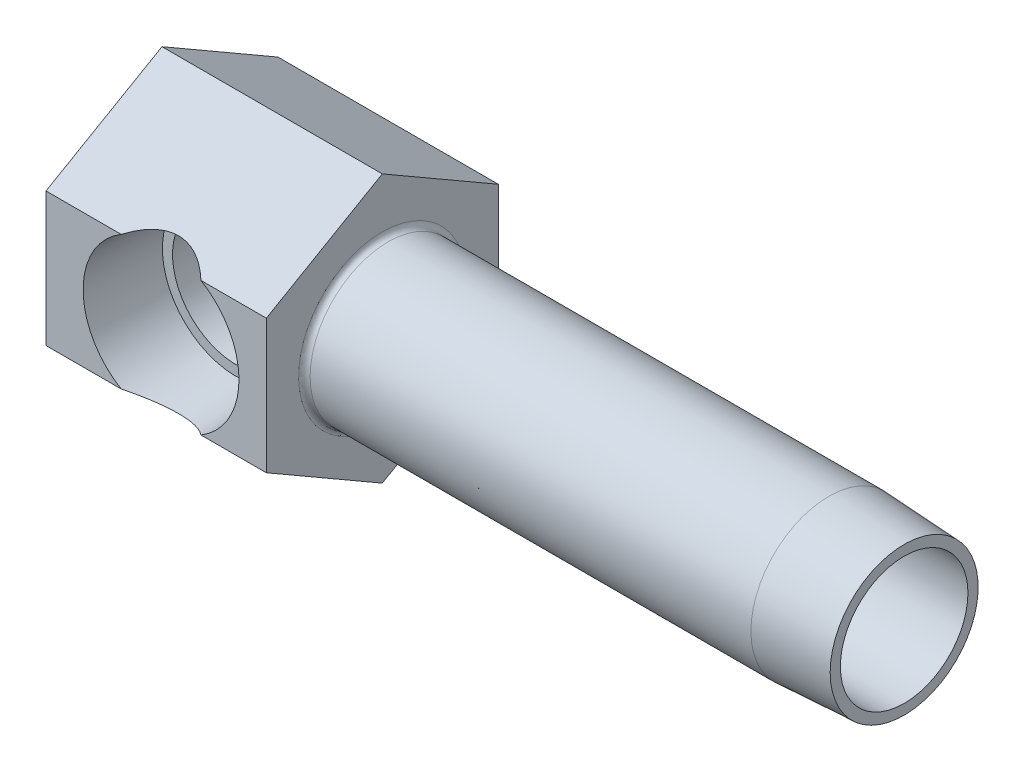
ISO-10303-21;
HEADER;
FILE_DESCRIPTION(('STEP AP214'),'2;1');
FILE_NAME('part.step','',(''),(''),'','','');
FILE_SCHEMA(('AUTOMOTIVE_DESIGN { 1 0 10303 214 1 1 1 1 }'));
ENDSEC;
DATA;
#1=APPLICATION_CONTEXT('core data for automotive mechanical design processes');
#2=APPLICATION_PROTOCOL_DEFINITION('international standard','automotive_design',2000,#1);
#3=PRODUCT_CONTEXT('',#1,'mechanical');
#4=PRODUCT('Part','Part','',(#3));
#5=PRODUCT_RELATED_PRODUCT_CATEGORY('part','',(#4));
#6=PRODUCT_DEFINITION_FORMATION('','',#4);
#7=PRODUCT_DEFINITION_CONTEXT('part definition',#1,'design');
#8=PRODUCT_DEFINITION('design','',#6,#7);
#9=PRODUCT_DEFINITION_SHAPE('','',#8);
#10=(LENGTH_UNIT() NAMED_UNIT(*) SI_UNIT(.MILLI.,.METRE.));
#11=(NAMED_UNIT(*) PLANE_ANGLE_UNIT() SI_UNIT($,.RADIAN.));
#12=(NAMED_UNIT(*) SI_UNIT($,.STERADIAN.) SOLID_ANGLE_UNIT());
#13=UNCERTAINTY_MEASURE_WITH_UNIT(LENGTH_MEASURE(1.E-05),#10,'distance_accuracy_value','');
#14=(GEOMETRIC_REPRESENTATION_CONTEXT(3) GLOBAL_UNCERTAINTY_ASSIGNED_CONTEXT((#13)) GLOBAL_UNIT_ASSIGNED_CONTEXT((#10,
#11,#12)) REPRESENTATION_CONTEXT('',''));
#15=CARTESIAN_POINT('',(0.,0.,0.));
#16=DIRECTION('',(0.,0.,1.));
#17=DIRECTION('',(1.,0.,0.));
#18=AXIS2_PLACEMENT_3D('',#15,#16,#17);
#19=CARTESIAN_POINT('',(63.5,0.,15.875));
#20=DIRECTION('',(-1.,0.,0.));
#21=DIRECTION('',(0.,0.,1.));
#22=AXIS2_PLACEMENT_3D('',#19,#20,#21);
#23=CYLINDRICAL_SURFACE('',#22,10.668);
#24=CARTESIAN_POINT('',(30.9499,0.,15.875));
#25=DIRECTION('',(1.,0.,0.));
#26=DIRECTION('',(0.,1.,0.));
#27=AXIS2_PLACEMENT_3D('',#24,#25,#26);
#28=CIRCLE('',#27,10.668);
#29=CARTESIAN_POINT('',(30.9499,10.668,15.875));
#30=VERTEX_POINT('',#29);
#31=EDGE_CURVE('E191',#30,#30,#28,.T.);
#32=ORIENTED_EDGE('',*,*,#31,.T.);
#33=EDGE_LOOP('',(#32));
#34=FACE_BOUND('',#33,.T.);
#35=CARTESIAN_POINT('',(91.2876,0.,15.875));
#36=DIRECTION('',(-1.,0.,0.));
#37=DIRECTION('',(0.,0.,1.));
#38=AXIS2_PLACEMENT_3D('',#35,#36,#37);
#39=CIRCLE('',#38,10.668);
#40=CARTESIAN_POINT('',(91.2876,0.,26.543));
#41=VERTEX_POINT('',#40);
#42=EDGE_CURVE('E256',#41,#41,#39,.T.);
#43=ORIENTED_EDGE('',*,*,#42,.T.);
#44=EDGE_LOOP('',(#43));
#45=FACE_BOUND('',#44,.T.);
#46=ADVANCED_FACE('F15',(#34,#45),#23,.T.);
#47=CARTESIAN_POINT('',(30.1625,18.3308710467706,15.875));
#48=DIRECTION('',(0.,-0.866025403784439,-0.5));
#49=DIRECTION('',(0.,0.5,-0.866025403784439));
#50=AXIS2_PLACEMENT_3D('',#47,#48,#49);
#51=PLANE('',#50);
#52=CARTESIAN_POINT('',(15.748,-1.05255916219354,49.4480859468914));
#53=DIRECTION('',(0.,-0.866025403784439,-0.5));
#54=DIRECTION('',(0.,-0.5,0.866025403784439));
#55=AXIS2_PLACEMENT_3D('',#52,#53,#54);
#56=ELLIPSE('',#55,23.191034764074,11.5476466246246);
#57=CARTESIAN_POINT('',(21.2070306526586,9.16543552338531,31.75));
#58=VERTEX_POINT('',#57);
#59=CARTESIAN_POINT('',(10.2889693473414,9.16543552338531,31.75));
#60=VERTEX_POINT('',#59);
#61=EDGE_CURVE('E135',#58,#60,#56,.F.);
#62=ORIENTED_EDGE('',*,*,#61,.F.);
#63=DIRECTION('',(-1.,0.,0.));
#64=VECTOR('',#63,1.);
#65=CARTESIAN_POINT('',(30.1625,9.16543552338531,31.75));
#66=LINE('',#65,#64);
#67=CARTESIAN_POINT('',(30.1625,9.16543552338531,31.75));
#68=VERTEX_POINT('',#67);
#69=EDGE_CURVE('E179',#68,#58,#66,.T.);
#70=ORIENTED_EDGE('',*,*,#69,.F.);
#71=DIRECTION('',(0.,-0.5,0.866025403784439));
#72=VECTOR('',#71,1.);
#73=CARTESIAN_POINT('',(30.1625,18.3308710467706,15.875));
#74=LINE('',#73,#72);
#75=CARTESIAN_POINT('',(30.1625,18.3308710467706,15.875));
#76=VERTEX_POINT('',#75);
#77=EDGE_CURVE('E163',#76,#68,#74,.T.);
#78=ORIENTED_EDGE('',*,*,#77,.F.);
#79=DIRECTION('',(-1.,0.,0.));
#80=VECTOR('',#79,1.);
#81=CARTESIAN_POINT('',(30.1625,18.3308710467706,15.875));
#82=LINE('',#81,#80);
#83=CARTESIAN_POINT('',(0.,18.3308710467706,15.875));
#84=VERTEX_POINT('',#83);
#85=EDGE_CURVE('E182',#76,#84,#82,.T.);
#86=ORIENTED_EDGE('',*,*,#85,.T.);
#87=DIRECTION('',(0.,-0.5,0.866025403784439));
#88=VECTOR('',#87,1.);
#89=CARTESIAN_POINT('',(0.,18.3308710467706,15.875));
#90=LINE('',#89,#88);
#91=CARTESIAN_POINT('',(0.,9.16543552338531,31.75));
#92=VERTEX_POINT('',#91);
#93=EDGE_CURVE('E144',#84,#92,#90,.T.);
#94=ORIENTED_EDGE('',*,*,#93,.T.);
#95=EDGE_CURVE('E178',#60,#92,#66,.T.);
#96=ORIENTED_EDGE('',*,*,#95,.F.);
#97=EDGE_LOOP('',(#62,#70,#78,#86,#94,#96));
#98=FACE_BOUND('',#97,.T.);
#99=ADVANCED_FACE('F210',(#98),#51,.F.);
#100=CARTESIAN_POINT('',(30.1625,9.16543552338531,31.75));
#101=DIRECTION('',(0.,0.,-1.));
#102=DIRECTION('',(-1.,0.,0.));
#103=AXIS2_PLACEMENT_3D('',#100,#101,#102);
#104=PLANE('',#103);
#105=CARTESIAN_POINT('',(15.748,0.,31.75));
#106=DIRECTION('',(0.,0.,-1.));
#107=DIRECTION('',(-1.,0.,0.));
#108=AXIS2_PLACEMENT_3D('',#105,#106,#107);
#109=CIRCLE('',#108,10.668);
#110=CARTESIAN_POINT('',(21.2070306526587,-9.1654355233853,31.75));
#111=VERTEX_POINT('',#110);
#112=EDGE_CURVE('E133',#58,#111,#109,.T.);
#113=ORIENTED_EDGE('',*,*,#112,.T.);
#114=DIRECTION('',(-1.,0.,0.));
#115=VECTOR('',#114,1.);
#116=CARTESIAN_POINT('',(30.1625,-9.1654355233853,31.75));
#117=LINE('',#116,#115);
#118=CARTESIAN_POINT('',(30.1625,-9.1654355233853,31.75));
#119=VERTEX_POINT('',#118);
#120=EDGE_CURVE('E175',#119,#111,#117,.T.);
#121=ORIENTED_EDGE('',*,*,#120,.F.);
#122=DIRECTION('',(0.,-1.,0.));
#123=VECTOR('',#122,1.);
#124=CARTESIAN_POINT('',(30.1625,9.16543552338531,31.75));
#125=LINE('',#124,#123);
#126=EDGE_CURVE('E165',#68,#119,#125,.T.);
#127=ORIENTED_EDGE('',*,*,#126,.F.);
#128=ORIENTED_EDGE('',*,*,#69,.T.);
#129=EDGE_LOOP('',(#113,#121,#127,#128));
#130=FACE_BOUND('',#129,.T.);
#131=ADVANCED_FACE('F206',(#130),#104,.F.);
#132=CARTESIAN_POINT('',(10.2889693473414,-9.1654355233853,31.75));
#133=VERTEX_POINT('',#132);
#134=EDGE_CURVE('E40',#133,#60,#109,.T.);
#135=ORIENTED_EDGE('',*,*,#134,.T.);
#136=ORIENTED_EDGE('',*,*,#95,.T.);
#137=DIRECTION('',(0.,-1.,0.));
#138=VECTOR('',#137,1.);
#139=CARTESIAN_POINT('',(0.,9.16543552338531,31.75));
#140=LINE('',#139,#138);
#141=CARTESIAN_POINT('',(0.,-9.1654355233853,31.75));
#142=VERTEX_POINT('',#141);
#143=EDGE_CURVE('E148',#92,#142,#140,.T.);
#144=ORIENTED_EDGE('',*,*,#143,.T.);
#145=EDGE_CURVE('E174',#133,#142,#117,.T.);
#146=ORIENTED_EDGE('',*,*,#145,.F.);
#147=EDGE_LOOP('',(#135,#136,#144,#146));
#148=FACE_BOUND('',#147,.T.);
#149=ADVANCED_FACE('F213',(#148),#104,.F.);
#150=CARTESIAN_POINT('',(30.1625,-9.1654355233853,31.75));
#151=DIRECTION('',(0.,0.866025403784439,-0.5));
#152=DIRECTION('',(0.,0.5,0.866025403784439));
#153=AXIS2_PLACEMENT_3D('',#150,#151,#152);
#154=PLANE('',#153);
#155=CARTESIAN_POINT('',(15.748,1.05255916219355,49.4480859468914));
#156=DIRECTION('',(0.,0.866025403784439,-0.5));
#157=DIRECTION('',(0.,0.5,0.866025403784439));
#158=AXIS2_PLACEMENT_3D('',#155,#156,#157);
#159=ELLIPSE('',#158,23.191034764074,11.5476466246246);
#160=EDGE_CURVE('E26',#133,#111,#159,.F.);
#161=ORIENTED_EDGE('',*,*,#160,.F.);
#162=ORIENTED_EDGE('',*,*,#145,.T.);
#163=DIRECTION('',(0.,-0.5,-0.866025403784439));
#164=VECTOR('',#163,1.);
#165=CARTESIAN_POINT('',(0.,-9.1654355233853,31.75));
#166=LINE('',#165,#164);
#167=CARTESIAN_POINT('',(0.,-18.3308710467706,15.875));
#168=VERTEX_POINT('',#167);
#169=EDGE_CURVE('E152',#142,#168,#166,.T.);
#170=ORIENTED_EDGE('',*,*,#169,.T.);
#171=DIRECTION('',(-1.,0.,0.));
#172=VECTOR('',#171,1.);
#173=CARTESIAN_POINT('',(30.1625,-18.3308710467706,15.875));
#174=LINE('',#173,#172);
#175=CARTESIAN_POINT('',(30.1625,-18.3308710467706,15.875));
#176=VERTEX_POINT('',#175);
#177=EDGE_CURVE('E169',#176,#168,#174,.T.);
#178=ORIENTED_EDGE('',*,*,#177,.F.);
#179=DIRECTION('',(0.,-0.5,-0.866025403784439));
#180=VECTOR('',#179,1.);
#181=CARTESIAN_POINT('',(30.1625,-9.1654355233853,31.75));
#182=LINE('',#181,#180);
#183=EDGE_CURVE('E167',#119,#176,#182,.T.);
#184=ORIENTED_EDGE('',*,*,#183,.F.);
#185=ORIENTED_EDGE('',*,*,#120,.T.);
#186=EDGE_LOOP('',(#161,#162,#170,#178,#184,#185));
#187=FACE_BOUND('',#186,.T.);
#188=ADVANCED_FACE('F202',(#187),#154,.F.);
#189=CARTESIAN_POINT('',(30.1625,-18.3308710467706,15.875));
#190=DIRECTION('',(0.,0.866025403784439,0.5));
#191=DIRECTION('',(0.,-0.5,0.866025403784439));
#192=AXIS2_PLACEMENT_3D('',#189,#190,#191);
#193=PLANE('',#192);
#194=DIRECTION('',(0.,0.5,-0.866025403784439));
#195=VECTOR('',#194,1.);
#196=CARTESIAN_POINT('',(0.,-18.3308710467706,15.875));
#197=LINE('',#196,#195);
#198=CARTESIAN_POINT('',(0.,-9.16543552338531,0.));
#199=VERTEX_POINT('',#198);
#200=EDGE_CURVE('E137',#168,#199,#197,.T.);
#201=ORIENTED_EDGE('',*,*,#200,.T.);
#202=DIRECTION('',(-1.,0.,0.));
#203=VECTOR('',#202,1.);
#204=CARTESIAN_POINT('',(30.1625,-9.16543552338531,0.));
#205=LINE('',#204,#203);
#206=CARTESIAN_POINT('',(30.1625,-9.16543552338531,0.));
#207=VERTEX_POINT('',#206);
#208=EDGE_CURVE('E188',#207,#199,#205,.T.);
#209=ORIENTED_EDGE('',*,*,#208,.F.);
#210=DIRECTION('',(0.,0.5,-0.866025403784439));
#211=VECTOR('',#210,1.);
#212=CARTESIAN_POINT('',(30.1625,-18.3308710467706,15.875));
#213=LINE('',#212,#211);
#214=EDGE_CURVE('E155',#176,#207,#213,.T.);
#215=ORIENTED_EDGE('',*,*,#214,.F.);
#216=ORIENTED_EDGE('',*,*,#177,.T.);
#217=EDGE_LOOP('',(#201,#209,#215,#216));
#218=FACE_BOUND('',#217,.T.);
#219=ADVANCED_FACE('F220',(#218),#193,.F.);
#220=CARTESIAN_POINT('',(30.1625,-9.16543552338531,0.));
#221=DIRECTION('',(0.,0.,1.));
#222=DIRECTION('',(0.,-1.,0.));
#223=AXIS2_PLACEMENT_3D('',#220,#221,#222);
#224=PLANE('',#223);
#225=DIRECTION('',(0.,1.,0.));
#226=VECTOR('',#225,1.);
#227=CARTESIAN_POINT('',(0.,-9.16543552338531,0.));
#228=LINE('',#227,#226);
#229=CARTESIAN_POINT('',(0.,9.16543552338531,0.));
#230=VERTEX_POINT('',#229);
#231=EDGE_CURVE('E138',#199,#230,#228,.T.);
#232=ORIENTED_EDGE('',*,*,#231,.T.);
#233=DIRECTION('',(-1.,0.,0.));
#234=VECTOR('',#233,1.);
#235=CARTESIAN_POINT('',(30.1625,9.16543552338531,0.));
#236=LINE('',#235,#234);
#237=CARTESIAN_POINT('',(30.1625,9.16543552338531,0.));
#238=VERTEX_POINT('',#237);
#239=EDGE_CURVE('E185',#238,#230,#236,.T.);
#240=ORIENTED_EDGE('',*,*,#239,.F.);
#241=DIRECTION('',(0.,1.,0.));
#242=VECTOR('',#241,1.);
#243=CARTESIAN_POINT('',(30.1625,-9.16543552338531,0.));
#244=LINE('',#243,#242);
#245=EDGE_CURVE('E159',#207,#238,#244,.T.);
#246=ORIENTED_EDGE('',*,*,#245,.F.);
#247=ORIENTED_EDGE('',*,*,#208,.T.);
#248=EDGE_LOOP('',(#232,#240,#246,#247));
#249=FACE_BOUND('',#248,.T.);
#250=ADVANCED_FACE('F227',(#249),#224,.F.);
#251=CARTESIAN_POINT('',(30.1625,9.16543552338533,0.));
#252=DIRECTION('',(0.,-0.86602540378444,0.5));
#253=DIRECTION('',(0.,-0.5,-0.86602540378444));
#254=AXIS2_PLACEMENT_3D('',#251,#252,#253);
#255=PLANE('',#254);
#256=DIRECTION('',(0.,0.5,0.86602540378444));
#257=VECTOR('',#256,1.);
#258=CARTESIAN_POINT('',(0.,9.16543552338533,0.));
#259=LINE('',#258,#257);
#260=EDGE_CURVE('E141',#230,#84,#259,.T.);
#261=ORIENTED_EDGE('',*,*,#260,.T.);
#262=ORIENTED_EDGE('',*,*,#85,.F.);
#263=DIRECTION('',(0.,0.5,0.86602540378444));
#264=VECTOR('',#263,1.);
#265=CARTESIAN_POINT('',(30.1625,9.16543552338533,0.));
#266=LINE('',#265,#264);
#267=EDGE_CURVE('E161',#238,#76,#266,.T.);
#268=ORIENTED_EDGE('',*,*,#267,.F.);
#269=ORIENTED_EDGE('',*,*,#239,.T.);
#270=EDGE_LOOP('',(#261,#262,#268,#269));
#271=FACE_BOUND('',#270,.T.);
#272=ADVANCED_FACE('F233',(#271),#255,.F.);
#273=CARTESIAN_POINT('',(30.1625,-9.16543552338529,0.));
#274=DIRECTION('',(1.,0.,0.));
#275=DIRECTION('',(0.,1.,0.));
#276=AXIS2_PLACEMENT_3D('',#273,#274,#275);
#277=PLANE('',#276);
#278=CARTESIAN_POINT('',(30.1625,0.,15.875));
#279=DIRECTION('',(1.,0.,0.));
#280=DIRECTION('',(0.,1.,0.));
#281=AXIS2_PLACEMENT_3D('',#278,#279,#280);
#282=CIRCLE('',#281,11.4554);
#283=CARTESIAN_POINT('',(30.1625,11.4554,15.875));
#284=VERTEX_POINT('',#283);
#285=EDGE_CURVE('E194',#284,#284,#282,.F.);
#286=ORIENTED_EDGE('',*,*,#285,.T.);
#287=EDGE_LOOP('',(#286));
#288=FACE_BOUND('',#287,.T.);
#289=ORIENTED_EDGE('',*,*,#214,.T.);
#290=ORIENTED_EDGE('',*,*,#245,.T.);
#291=ORIENTED_EDGE('',*,*,#267,.T.);
#292=ORIENTED_EDGE('',*,*,#77,.T.);
#293=ORIENTED_EDGE('',*,*,#126,.T.);
#294=ORIENTED_EDGE('',*,*,#183,.T.);
#295=EDGE_LOOP('',(#289,#290,#291,#292,#293,#294));
#296=FACE_BOUND('',#295,.T.);
#297=ADVANCED_FACE('F230',(#288,#296),#277,.T.);
#298=CARTESIAN_POINT('',(0.,-9.16543552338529,0.));
#299=DIRECTION('',(1.,0.,0.));
#300=DIRECTION('',(0.,1.,0.));
#301=AXIS2_PLACEMENT_3D('',#298,#299,#300);
#302=PLANE('',#301);
#303=ORIENTED_EDGE('',*,*,#200,.F.);
#304=ORIENTED_EDGE('',*,*,#169,.F.);
#305=ORIENTED_EDGE('',*,*,#143,.F.);
#306=ORIENTED_EDGE('',*,*,#93,.F.);
#307=ORIENTED_EDGE('',*,*,#260,.F.);
#308=ORIENTED_EDGE('',*,*,#231,.F.);
#309=EDGE_LOOP('',(#303,#304,#305,#306,#307,#308));
#310=FACE_BOUND('',#309,.T.);
#311=ADVANCED_FACE('F222',(#310),#302,.F.);
#312=CARTESIAN_POINT('',(30.9499,0.,15.875));
#313=DIRECTION('',(1.,0.,0.));
#314=DIRECTION('',(0.,1.,0.));
#315=AXIS2_PLACEMENT_3D('',#312,#313,#314);
#316=TOROIDAL_SURFACE('',#315,11.4554,0.7874);
#317=ORIENTED_EDGE('',*,*,#285,.F.);
#318=EDGE_LOOP('',(#317));
#319=FACE_BOUND('',#318,.T.);
#320=ORIENTED_EDGE('',*,*,#31,.F.);
#321=EDGE_LOOP('',(#320));
#322=FACE_BOUND('',#321,.T.);
#323=ADVANCED_FACE('F330',(#319,#322),#316,.F.);
#324=CARTESIAN_POINT('',(15.748,0.,31.75));
#325=DIRECTION('',(0.,0.,1.));
#326=DIRECTION('',(1.,0.,0.));
#327=AXIS2_PLACEMENT_3D('',#324,#325,#326);
#328=CONICAL_SURFACE('',#327,10.668,0.0523598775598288);
#329=CARTESIAN_POINT('',(23.3158678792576,-6.73011387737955,21.4374));
#330=CARTESIAN_POINT('',(23.4600282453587,-6.58213571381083,21.6163914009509));
#331=CARTESIAN_POINT('',(23.6023884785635,-6.42627781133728,21.7904706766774));
#332=CARTESIAN_POINT('',(23.8817354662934,-6.09837401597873,22.1280133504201));
#333=CARTESIAN_POINT('',(24.0187135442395,-5.92630339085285,22.2914598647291));
#334=CARTESIAN_POINT('',(24.2862441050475,-5.56440643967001,22.6077795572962));
#335=CARTESIAN_POINT('',(24.4167288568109,-5.37443622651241,22.7605461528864));
#336=CARTESIAN_POINT('',(24.6677167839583,-4.97815123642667,23.0522714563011));
#337=CARTESIAN_POINT('',(24.7882261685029,-4.77184678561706,23.1912387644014));
#338=CARTESIAN_POINT('',(24.9921660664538,-4.38969848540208,23.4250980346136));
#339=CARTESIAN_POINT('',(25.0779672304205,-4.21696245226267,23.5230096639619));
#340=CARTESIAN_POINT('',(25.2408840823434,-3.86199712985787,23.7082473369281));
#341=CARTESIAN_POINT('',(25.3180018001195,-3.67977007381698,23.7955758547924));
#342=CARTESIAN_POINT('',(25.4621670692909,-3.30686520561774,23.9583559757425));
#343=CARTESIAN_POINT('',(25.529240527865,-3.11621083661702,24.0338381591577));
#344=CARTESIAN_POINT('',(25.6523303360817,-2.72696762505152,24.1720474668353));
#345=CARTESIAN_POINT('',(25.7083523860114,-2.52838293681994,24.2347811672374));
#346=CARTESIAN_POINT('',(25.808749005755,-2.12236093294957,24.3470188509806));
#347=CARTESIAN_POINT('',(25.8530023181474,-1.91485526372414,24.3963851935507));
#348=CARTESIAN_POINT('',(25.9281094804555,-1.49442789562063,24.4800766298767));
#349=CARTESIAN_POINT('',(25.9589631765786,-1.2815061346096,24.5144015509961));
#350=CARTESIAN_POINT('',(26.0065047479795,-0.852126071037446,24.5672608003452));
#351=CARTESIAN_POINT('',(26.023192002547,-0.635667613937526,24.5857944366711));
#352=CARTESIAN_POINT('',(26.0419565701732,-0.201352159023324,24.6066338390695));
#353=CARTESIAN_POINT('',(26.0440358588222,0.0165046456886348,24.6089417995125));
#354=CARTESIAN_POINT('',(26.0342583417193,0.421689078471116,24.5980844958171));
#355=CARTESIAN_POINT('',(26.0242658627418,0.609123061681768,24.5869892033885));
#356=CARTESIAN_POINT('',(25.9935596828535,0.982016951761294,24.552869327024));
#357=CARTESIAN_POINT('',(25.9728460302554,1.16747686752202,24.5298447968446));
#358=CARTESIAN_POINT('',(25.9211099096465,1.53498981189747,24.4722733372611));
#359=CARTESIAN_POINT('',(25.8900948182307,1.71704518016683,24.437734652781));
#360=CARTESIAN_POINT('',(25.8183100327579,2.07675633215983,24.3576745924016));
#361=CARTESIAN_POINT('',(25.7775399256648,2.25441192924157,24.3121527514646));
#362=CARTESIAN_POINT('',(25.6868155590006,2.6047674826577,24.2106610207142));
#363=CARTESIAN_POINT('',(25.6368406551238,2.77745527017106,24.1546676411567));
#364=CARTESIAN_POINT('',(25.5285266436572,3.11671661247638,24.0330221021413));
#365=CARTESIAN_POINT('',(25.4701845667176,3.28328797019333,23.9673665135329));
#366=CARTESIAN_POINT('',(25.2834921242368,3.77365322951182,23.7566792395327));
#367=CARTESIAN_POINT('',(25.1436492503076,4.08744436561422,23.5981203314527));
#368=CARTESIAN_POINT('',(24.8735653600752,4.61896069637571,23.289353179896));
#369=CARTESIAN_POINT('',(24.7480029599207,4.84261456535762,23.1450088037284));
#370=CARTESIAN_POINT('',(24.4850001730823,5.27158893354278,22.8402219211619));
#371=CARTESIAN_POINT('',(24.34754826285,5.47689124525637,22.6797637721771));
#372=CARTESIAN_POINT('',(24.0644488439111,5.86754844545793,22.3458754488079));
#373=CARTESIAN_POINT('',(23.918859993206,6.05302358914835,22.1725357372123));
#374=CARTESIAN_POINT('',(23.6957580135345,6.31733501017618,21.90341371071));
#375=CARTESIAN_POINT('',(23.6206767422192,6.40304815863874,21.8122772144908));
#376=CARTESIAN_POINT('',(23.4691939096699,6.56995442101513,21.6270388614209));
#377=CARTESIAN_POINT('',(23.3927925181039,6.65114811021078,21.5329373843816));
#378=CARTESIAN_POINT('',(23.3158678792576,6.73011387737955,21.4374));
#379=B_SPLINE_CURVE_WITH_KNOTS('',3,(#329,#330,#331,#332,#333,#334,#335,#336,#337,#338,#339,
#340,#341,#342,#343,#344,#345,#346,#347,#348,#349,#350,#351,#352,#353,#354,#355,#356,#357,#358,
#359,#360,#361,#362,#363,#364,#365,#366,#367,#368,#369,#370,#371,#372,#373,#374,#375,#376,#377,
#378),.UNSPECIFIED.,.F.,.F.,(4,2,2,2,2,2,2,2,2,2,2,2,2,2,2,2,2,2,2,2,2,2,2,2,4),(0.,
0.820023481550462,1.64131879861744,2.46989520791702,3.29795193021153,3.94627694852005,
4.59445010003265,5.24092150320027,5.8870585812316,6.53961554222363,7.19217999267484,
7.84477303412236,8.49727781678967,9.06067705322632,9.6240737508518,10.187067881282,
10.7500858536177,11.3143822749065,11.8788794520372,13.0099648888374,13.8917191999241,
14.7743379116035,15.65125682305,16.0888974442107,16.5264822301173),.UNSPECIFIED.);
#380=CARTESIAN_POINT('',(23.3160289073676,-6.72994857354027,21.4376));
#381=VERTEX_POINT('',#380);
#382=CARTESIAN_POINT('',(23.3160289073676,6.72994857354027,21.4376));
#383=VERTEX_POINT('',#382);
#384=EDGE_CURVE('E119',#381,#383,#379,.T.);
#385=ORIENTED_EDGE('',*,*,#384,.F.);
#386=CARTESIAN_POINT('',(15.748,0.,21.4376));
#387=DIRECTION('',(0.,0.,-1.));
#388=DIRECTION('',(-1.,0.,0.));
#389=AXIS2_PLACEMENT_3D('',#386,#387,#388);
#390=CIRCLE('',#389,10.1275500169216);
#391=EDGE_CURVE('E121',#381,#383,#390,.T.);
#392=ORIENTED_EDGE('',*,*,#391,.T.);
#393=EDGE_LOOP('',(#385,#392));
#394=FACE_BOUND('',#393,.T.);
#395=ORIENTED_EDGE('',*,*,#61,.T.);
#396=ORIENTED_EDGE('',*,*,#134,.F.);
#397=ORIENTED_EDGE('',*,*,#160,.T.);
#398=ORIENTED_EDGE('',*,*,#112,.F.);
#399=EDGE_LOOP('',(#395,#396,#397,#398));
#400=FACE_BOUND('',#399,.T.);
#401=ADVANCED_FACE('F196',(#394,#400),#328,.F.);
#402=CARTESIAN_POINT('',(25.8755500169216,0.,21.4376));
#403=DIRECTION('',(0.,0.,1.));
#404=DIRECTION('',(1.,0.,0.));
#405=AXIS2_PLACEMENT_3D('',#402,#403,#404);
#406=PLANE('',#405);
#407=DIRECTION('',(1.,0.,0.));
#408=VECTOR('',#407,1.);
#409=CARTESIAN_POINT('',(86.8155901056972,-6.72994857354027,21.4376));
#410=LINE('',#409,#408);
#411=CARTESIAN_POINT('',(21.3205618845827,-6.72994857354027,21.4376));
#412=VERTEX_POINT('',#411);
#413=EDGE_CURVE('E123',#412,#381,#410,.T.);
#414=ORIENTED_EDGE('',*,*,#413,.F.);
#415=CARTESIAN_POINT('',(15.748,0.,21.4376));
#416=DIRECTION('',(0.,0.,-1.));
#417=DIRECTION('',(-1.,0.,0.));
#418=AXIS2_PLACEMENT_3D('',#415,#416,#417);
#419=CIRCLE('',#418,8.7376);
#420=CARTESIAN_POINT('',(21.3205618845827,6.72994857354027,21.4376));
#421=VERTEX_POINT('',#420);
#422=EDGE_CURVE('E114',#412,#421,#419,.T.);
#423=ORIENTED_EDGE('',*,*,#422,.T.);
#424=DIRECTION('',(1.,0.,0.));
#425=VECTOR('',#424,1.);
#426=CARTESIAN_POINT('',(86.8155901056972,6.72994857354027,21.4376));
#427=LINE('',#426,#425);
#428=EDGE_CURVE('E115',#383,#421,#427,.F.);
#429=ORIENTED_EDGE('',*,*,#428,.F.);
#430=ORIENTED_EDGE('',*,*,#391,.F.);
#431=EDGE_LOOP('',(#414,#423,#429,#430));
#432=FACE_BOUND('',#431,.T.);
#433=ADVANCED_FACE('F316',(#432),#406,.T.);
#434=CARTESIAN_POINT('',(15.748,0.,43.0975954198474));
#435=DIRECTION('',(0.,0.,-1.));
#436=DIRECTION('',(-1.,0.,0.));
#437=AXIS2_PLACEMENT_3D('',#434,#435,#436);
#438=CYLINDRICAL_SURFACE('',#437,8.7376);
#439=CARTESIAN_POINT('',(24.4856,0.,7.14375000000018));
#440=CARTESIAN_POINT('',(24.4855979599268,-0.194584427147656,7.14375204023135));
#441=CARTESIAN_POINT('',(24.4790855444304,-0.389211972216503,7.15026918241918));
#442=CARTESIAN_POINT('',(24.4531687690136,-0.776828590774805,7.17620489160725));
#443=CARTESIAN_POINT('',(24.4337566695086,-0.969816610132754,7.19563120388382));
#444=CARTESIAN_POINT('',(24.3824080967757,-1.35279132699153,7.24701779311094));
#445=CARTESIAN_POINT('',(24.3504484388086,-1.54277178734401,7.27900127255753));
#446=CARTESIAN_POINT('',(24.2746397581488,-1.91800162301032,7.3548673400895));
#447=CARTESIAN_POINT('',(24.230784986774,-2.10324866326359,7.39875568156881));
#448=CARTESIAN_POINT('',(24.1323992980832,-2.46629304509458,7.49721818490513));
#449=CARTESIAN_POINT('',(24.0779544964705,-2.64413729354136,7.55170615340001));
#450=CARTESIAN_POINT('',(23.9590478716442,-2.99304779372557,7.6707093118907));
#451=CARTESIAN_POINT('',(23.8945822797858,-3.16411146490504,7.73522827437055));
#452=CARTESIAN_POINT('',(23.7566100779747,-3.49864884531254,7.87331790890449));
#453=CARTESIAN_POINT('',(23.6831076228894,-3.66212599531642,7.94688442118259));
#454=CARTESIAN_POINT('',(23.5279457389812,-3.98115293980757,8.10218588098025));
#455=CARTESIAN_POINT('',(23.4462844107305,-4.13670087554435,8.18392273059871));
#456=CARTESIAN_POINT('',(23.2407563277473,-4.50158308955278,8.38964777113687));
#457=CARTESIAN_POINT('',(23.1132942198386,-4.7068770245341,8.51723745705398));
#458=CARTESIAN_POINT('',(22.84617651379,-5.10080513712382,8.7846388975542));
#459=CARTESIAN_POINT('',(22.7065197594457,-5.28943773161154,8.92445181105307));
#460=CARTESIAN_POINT('',(22.4166157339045,-5.65057111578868,9.21470277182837));
#461=CARTESIAN_POINT('',(22.2663444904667,-5.82303320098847,9.36516487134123));
#462=CARTESIAN_POINT('',(21.9571971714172,-6.15161912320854,9.67473646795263));
#463=CARTESIAN_POINT('',(21.7983210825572,-6.30774293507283,9.83384597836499));
#464=CARTESIAN_POINT('',(21.410466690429,-6.66146937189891,10.2223222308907));
#465=CARTESIAN_POINT('',(21.1781519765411,-6.85174414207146,10.4550504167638));
#466=CARTESIAN_POINT('',(20.7027527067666,-7.20301910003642,10.9314300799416));
#467=CARTESIAN_POINT('',(20.4596630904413,-7.36400534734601,11.1750866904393));
#468=CARTESIAN_POINT('',(19.9655914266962,-7.65767994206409,11.6705392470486));
#469=CARTESIAN_POINT('',(19.7146188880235,-7.79040098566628,11.922325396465));
#470=CARTESIAN_POINT('',(19.2066974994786,-8.0288054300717,12.432296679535));
#471=CARTESIAN_POINT('',(18.9497514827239,-8.13450137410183,12.6904787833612));
#472=CARTESIAN_POINT('',(18.535849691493,-8.28254836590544,13.1070621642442));
#473=CARTESIAN_POINT('',(18.3802144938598,-8.3332845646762,13.2638590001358));
#474=CARTESIAN_POINT('',(18.0678223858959,-8.42559206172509,13.5791092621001));
#475=CARTESIAN_POINT('',(17.9110652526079,-8.46716148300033,13.7375630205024));
#476=CARTESIAN_POINT('',(17.6309955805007,-8.53322740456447,14.0215802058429));
#477=CARTESIAN_POINT('',(17.5077848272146,-8.5594718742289,14.1468425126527));
#478=CARTESIAN_POINT('',(17.2618022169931,-8.60637337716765,14.3980579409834));
#479=CARTESIAN_POINT('',(17.1390302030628,-8.62704779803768,14.5240076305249));
#480=CARTESIAN_POINT('',(16.9357825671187,-8.65687758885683,14.7346643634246));
#481=CARTESIAN_POINT('',(16.8550481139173,-8.66756378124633,14.8189101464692));
#482=CARTESIAN_POINT('',(16.6937016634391,-8.68665280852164,14.9894220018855));
#483=CARTESIAN_POINT('',(16.6130990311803,-8.6950316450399,15.0756998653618));
#484=CARTESIAN_POINT('',(16.4936864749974,-8.70581636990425,15.2075729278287));
#485=CARTESIAN_POINT('',(16.453897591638,-8.70912835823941,15.2522143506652));
#486=CARTESIAN_POINT('',(16.3753514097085,-8.71513811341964,15.3428639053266));
#487=CARTESIAN_POINT('',(16.336600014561,-8.71783283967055,15.3888775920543));
#488=CARTESIAN_POINT('',(16.2623845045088,-8.72252382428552,15.4819945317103));
#489=CARTESIAN_POINT('',(16.2268715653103,-8.72453249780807,15.5290599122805));
#490=CARTESIAN_POINT('',(16.1615894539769,-8.72786360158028,15.6269900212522));
#491=CARTESIAN_POINT('',(16.1317624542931,-8.72919320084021,15.6778082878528));
#492=CARTESIAN_POINT('',(16.106026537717,-8.73026315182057,15.7432733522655));
#493=CARTESIAN_POINT('',(16.1020065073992,-8.73042652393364,15.7545502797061));
#494=CARTESIAN_POINT('',(16.0948910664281,-8.73071197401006,15.7773932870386));
#495=CARTESIAN_POINT('',(16.0917959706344,-8.73083403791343,15.788959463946));
#496=CARTESIAN_POINT('',(16.0842173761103,-8.7311305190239,15.8238300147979));
#497=CARTESIAN_POINT('',(16.0813461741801,-8.7312389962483,15.8475287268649));
#498=CARTESIAN_POINT('',(16.080808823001,-8.73125946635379,15.8951415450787));
#499=CARTESIAN_POINT('',(16.083177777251,-8.73117013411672,15.9190560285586));
#500=CARTESIAN_POINT('',(16.0925113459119,-8.73080677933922,15.9661053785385));
#501=CARTESIAN_POINT('',(16.099514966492,-8.73053118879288,15.9892318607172));
#502=CARTESIAN_POINT('',(16.1262284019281,-8.72942751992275,16.0598051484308));
#503=CARTESIAN_POINT('',(16.151337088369,-8.7283274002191,16.1050597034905));
#504=CARTESIAN_POINT('',(16.2067600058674,-8.72559491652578,16.1922079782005));
#505=CARTESIAN_POINT('',(16.2371111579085,-8.72395869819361,16.2340745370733));
#506=CARTESIAN_POINT('',(16.3394034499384,-8.71784635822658,16.3674166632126));
#507=CARTESIAN_POINT('',(16.4158450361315,-8.71237926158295,16.4553852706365));
#508=CARTESIAN_POINT('',(16.5713693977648,-8.69907947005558,16.6287851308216));
#509=CARTESIAN_POINT('',(16.6504566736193,-8.69124254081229,16.7142115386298));
#510=CARTESIAN_POINT('',(16.8096315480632,-8.67323190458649,16.8834717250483));
#511=CARTESIAN_POINT('',(16.8897156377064,-8.66306494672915,16.9673093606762));
#512=CARTESIAN_POINT('',(17.0502749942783,-8.64038918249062,17.1341543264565));
#513=CARTESIAN_POINT('',(17.1307499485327,-8.62788201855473,17.2171621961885));
#514=CARTESIAN_POINT('',(17.3707828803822,-8.58710464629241,17.463693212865));
#515=CARTESIAN_POINT('',(17.5305844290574,-8.5553951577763,17.626432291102));
#516=CARTESIAN_POINT('',(17.8496978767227,-8.48264950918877,17.9503078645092));
#517=CARTESIAN_POINT('',(18.0090097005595,-8.44161198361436,18.1114441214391));
#518=CARTESIAN_POINT('',(18.4856528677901,-8.30423407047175,18.592695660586));
#519=CARTESIAN_POINT('',(18.8014587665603,-8.1936672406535,18.9104166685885));
#520=CARTESIAN_POINT('',(19.4255974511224,-7.93318916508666,19.5375986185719));
#521=CARTESIAN_POINT('',(19.7339228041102,-7.78324040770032,19.8470513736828));
#522=CARTESIAN_POINT('',(20.3391141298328,-7.44229907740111,20.4540803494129));
#523=CARTESIAN_POINT('',(20.6359893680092,-7.25134054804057,20.7516661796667));
#524=CARTESIAN_POINT('',(21.1000219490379,-6.910044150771,21.2166598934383));
#525=CARTESIAN_POINT('',(21.2721889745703,-6.7733595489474,21.3891483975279));
#526=CARTESIAN_POINT('',(21.6095045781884,-6.48366113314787,21.7270430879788));
#527=CARTESIAN_POINT('',(21.7746536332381,-6.33064843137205,21.8924497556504));
#528=CARTESIAN_POINT('',(22.2570327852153,-5.84682072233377,22.3755293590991));
#529=CARTESIAN_POINT('',(22.5620480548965,-5.49060305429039,22.6809166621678));
#530=CARTESIAN_POINT('',(23.069916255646,-4.78392446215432,23.1893448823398));
#531=CARTESIAN_POINT('',(23.2811256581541,-4.44561570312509,23.4007639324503));
#532=CARTESIAN_POINT('',(23.5668242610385,-3.90553017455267,23.6867285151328));
#533=CARTESIAN_POINT('',(23.6568667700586,-3.72007663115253,23.7768515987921));
#534=CARTESIAN_POINT('',(23.8252338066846,-3.33876204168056,23.9453649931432));
#535=CARTESIAN_POINT('',(23.9035605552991,-3.14290297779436,24.0237575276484));
#536=CARTESIAN_POINT('',(24.0342740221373,-2.77741093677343,24.1545782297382));
#537=CARTESIAN_POINT('',(24.0887969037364,-2.60930304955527,24.2091448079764));
#538=CARTESIAN_POINT('',(24.1881404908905,-2.26745357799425,24.3085667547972));
#539=CARTESIAN_POINT('',(24.232963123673,-2.0937131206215,24.3534240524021));
#540=CARTESIAN_POINT('',(24.3121701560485,-1.74160557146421,24.4326916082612));
#541=CARTESIAN_POINT('',(24.3465592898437,-1.5632406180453,24.4671066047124));
#542=CARTESIAN_POINT('',(24.4043171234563,-1.20295803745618,24.5249075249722));
#543=CARTESIAN_POINT('',(24.427685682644,-1.02104036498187,24.548293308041));
#544=CARTESIAN_POINT('',(24.463023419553,-0.654283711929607,24.5836569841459));
#545=CARTESIAN_POINT('',(24.4749486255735,-0.46943621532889,24.5955908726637));
#546=CARTESIAN_POINT('',(24.4870048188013,-0.0989697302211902,24.6076558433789));
#547=CARTESIAN_POINT('',(24.4871357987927,0.086649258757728,24.6077869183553));
#548=CARTESIAN_POINT('',(24.4756009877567,0.457153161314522,24.59624371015));
#549=CARTESIAN_POINT('',(24.4639348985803,0.642038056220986,24.5845691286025));
#550=CARTESIAN_POINT('',(24.4290390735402,1.00960102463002,24.5496476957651));
#551=CARTESIAN_POINT('',(24.4058095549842,1.19227913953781,24.5264010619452));
#552=CARTESIAN_POINT('',(24.3499037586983,1.5435978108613,24.4704535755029));
#553=CARTESIAN_POINT('',(24.3178522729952,1.71243875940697,24.4383780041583));
#554=CARTESIAN_POINT('',(24.2443827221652,2.0460500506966,24.3648524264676));
#555=CARTESIAN_POINT('',(24.2029611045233,2.21081882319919,24.3233988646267));
#556=CARTESIAN_POINT('',(24.1113637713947,2.53539687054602,24.231729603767));
#557=CARTESIAN_POINT('',(24.0611880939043,2.69520616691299,24.1815139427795));
#558=CARTESIAN_POINT('',(23.9527394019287,3.0092382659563,24.0729769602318));
#559=CARTESIAN_POINT('',(23.8944647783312,3.16345995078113,24.0146540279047));
#560=CARTESIAN_POINT('',(23.7478576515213,3.52103226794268,23.8679223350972));
#561=CARTESIAN_POINT('',(23.6563189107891,3.72176242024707,23.776303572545));
#562=CARTESIAN_POINT('',(23.4611265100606,4.11105686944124,23.5809334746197));
#563=CARTESIAN_POINT('',(23.3574693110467,4.29961758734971,23.4771785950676));
#564=CARTESIAN_POINT('',(23.1395028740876,4.66439092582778,23.2589969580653));
#565=CARTESIAN_POINT('',(23.0251788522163,4.84058579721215,23.1445553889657));
#566=CARTESIAN_POINT('',(22.7874660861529,5.18020722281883,22.9065848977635));
#567=CARTESIAN_POINT('',(22.6640769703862,5.34363325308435,22.7830556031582));
#568=CARTESIAN_POINT('',(22.3624933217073,5.71583582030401,22.4811084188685));
#569=CARTESIAN_POINT('',(22.1808835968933,5.9190794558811,22.2992637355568));
#570=CARTESIAN_POINT('',(21.8058537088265,6.30238103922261,21.9236994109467));
#571=CARTESIAN_POINT('',(21.6124292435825,6.48243046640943,21.7299754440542));
#572=CARTESIAN_POINT('',(21.2157200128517,6.8203891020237,21.3325794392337));
#573=CARTESIAN_POINT('',(21.0124171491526,6.97825543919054,21.1288891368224));
#574=CARTESIAN_POINT('',(20.5982380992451,7.27223101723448,20.7138083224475));
#575=CARTESIAN_POINT('',(20.3873623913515,7.40834162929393,20.5024182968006));
#576=CARTESIAN_POINT('',(19.884649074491,7.70363293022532,19.9982794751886));
#577=CARTESIAN_POINT('',(19.59030513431,7.85421669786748,19.7029484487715));
#578=CARTESIAN_POINT('',(19.1430322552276,8.05270383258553,19.2536843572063));
#579=CARTESIAN_POINT('',(18.9929116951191,8.11432340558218,19.1028145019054));
#580=CARTESIAN_POINT('',(18.6911065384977,8.2285969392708,18.7992470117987));
#581=CARTESIAN_POINT('',(18.5394220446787,8.28125148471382,18.6465494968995));
#582=CARTESIAN_POINT('',(18.2352261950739,8.37763466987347,18.3399014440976));
#583=CARTESIAN_POINT('',(18.0827174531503,8.42138304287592,18.1859544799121));
#584=CARTESIAN_POINT('',(17.7769311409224,8.5002358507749,17.8765529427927));
#585=CARTESIAN_POINT('',(17.6236534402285,8.53533876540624,17.721098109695));
#586=CARTESIAN_POINT('',(17.3172180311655,8.59695458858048,17.4087584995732));
#587=CARTESIAN_POINT('',(17.164060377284,8.62347694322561,17.2518754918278));
#588=CARTESIAN_POINT('',(16.8589569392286,8.66804695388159,16.935768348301));
#589=CARTESIAN_POINT('',(16.7070105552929,8.68609909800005,16.7765454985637));
#590=CARTESIAN_POINT('',(16.46350407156,8.70877341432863,16.5098735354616));
#591=CARTESIAN_POINT('',(16.3699008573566,8.71589085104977,16.4044258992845));
#592=CARTESIAN_POINT('',(16.2323264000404,8.72430499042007,16.2291085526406));
#593=CARTESIAN_POINT('',(16.1841543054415,8.72679002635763,16.163138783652));
#594=CARTESIAN_POINT('',(16.133496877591,8.729101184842,16.0698810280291));
#595=CARTESIAN_POINT('',(16.1225051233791,8.72957575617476,16.0475182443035));
#596=CARTESIAN_POINT('',(16.1036531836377,8.73036364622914,16.0015173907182));
#597=CARTESIAN_POINT('',(16.0957832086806,8.73067746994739,15.9778835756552));
#598=CARTESIAN_POINT('',(16.0858252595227,8.73106804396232,15.9345234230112));
#599=CARTESIAN_POINT('',(16.0828762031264,8.73118048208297,15.9150042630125));
#600=CARTESIAN_POINT('',(16.0804848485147,8.73127193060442,15.8757632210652));
#601=CARTESIAN_POINT('',(16.0810378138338,8.73125112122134,15.8560416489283));
#602=CARTESIAN_POINT('',(16.085496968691,8.73107971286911,15.8170943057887));
#603=CARTESIAN_POINT('',(16.0893884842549,8.7309296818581,15.7978667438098));
#604=CARTESIAN_POINT('',(16.0998433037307,8.73051484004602,15.7601398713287));
#605=CARTESIAN_POINT('',(16.1064126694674,8.73024976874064,15.7416423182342));
#606=CARTESIAN_POINT('',(16.1364699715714,8.72898749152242,15.6687660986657));
#607=CARTESIAN_POINT('',(16.167275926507,8.72759479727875,15.6175941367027));
#608=CARTESIAN_POINT('',(16.2343481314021,8.72412321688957,15.51885530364));
#609=CARTESIAN_POINT('',(16.2706691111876,8.72203717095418,15.4713327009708));
#610=CARTESIAN_POINT('',(16.3943809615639,8.71408023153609,15.3171540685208));
#611=CARTESIAN_POINT('',(16.4865189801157,8.70682435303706,15.2143256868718));
#612=CARTESIAN_POINT('',(16.6731786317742,8.68900060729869,15.0111482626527));
#613=CARTESIAN_POINT('',(16.7677038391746,8.67842746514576,14.9108034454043));
#614=CARTESIAN_POINT('',(16.9573900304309,8.65402061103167,14.7119565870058));
#615=CARTESIAN_POINT('',(17.0525458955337,8.64020255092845,14.6134480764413));
#616=CARTESIAN_POINT('',(17.2430914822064,8.60927992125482,14.4173129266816));
#617=CARTESIAN_POINT('',(17.3384810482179,8.59217714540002,14.3196858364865));
#618=CARTESIAN_POINT('',(17.7459864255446,8.51203730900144,13.9038911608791));
#619=CARTESIAN_POINT('',(18.0580987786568,8.43292269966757,13.5886112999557));
#620=CARTESIAN_POINT('',(18.6776048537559,8.23825366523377,12.9641986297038));
#621=CARTESIAN_POINT('',(18.9849941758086,8.1226671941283,12.655071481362));
#622=CARTESIAN_POINT('',(19.5923220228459,7.85348929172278,12.0450114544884));
#623=CARTESIAN_POINT('',(19.8922482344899,7.6998391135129,11.744092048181));
#624=CARTESIAN_POINT('',(20.4804833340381,7.35294307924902,11.1542044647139));
#625=CARTESIAN_POINT('',(20.7688011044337,7.15972821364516,10.865227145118));
#626=CARTESIAN_POINT('',(21.2206780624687,6.81483228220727,10.4124550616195));
#627=CARTESIAN_POINT('',(21.3891940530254,6.67617271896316,10.2436383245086));
#628=CARTESIAN_POINT('',(21.7190895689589,6.38282740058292,9.91319894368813));
#629=CARTESIAN_POINT('',(21.8804695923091,6.22814276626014,9.75157579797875));
#630=CARTESIAN_POINT('',(22.3513310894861,5.73984762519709,9.28005235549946));
#631=CARTESIAN_POINT('',(22.6484248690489,5.38133142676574,8.9826055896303));
#632=CARTESIAN_POINT('',(23.141492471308,4.67228730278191,8.48900613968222));
#633=CARTESIAN_POINT('',(23.3459092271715,4.33363653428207,8.2843900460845));
#634=CARTESIAN_POINT('',(23.62145792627,3.79409663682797,8.00858862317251));
#635=CARTESIAN_POINT('',(23.7081391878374,3.60895802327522,7.92183082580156));
#636=CARTESIAN_POINT('',(23.8698120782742,3.2286920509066,7.76001907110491));
#637=CARTESIAN_POINT('',(23.9448062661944,3.03356689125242,7.68496255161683));
#638=CARTESIAN_POINT('',(24.0697191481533,2.66926471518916,7.55994813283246));
#639=CARTESIAN_POINT('',(24.1217294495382,2.50151910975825,7.50789648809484));
#640=CARTESIAN_POINT('',(24.2160793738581,2.16067893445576,7.41347268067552));
#641=CARTESIAN_POINT('',(24.2584209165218,1.98758543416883,7.37109859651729));
#642=CARTESIAN_POINT('',(24.3326749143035,1.63737162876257,7.29678816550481));
#643=CARTESIAN_POINT('',(24.3646094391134,1.46026070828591,7.26482973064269));
#644=CARTESIAN_POINT('',(24.4175977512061,1.10287331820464,7.21180203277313));
#645=CARTESIAN_POINT('',(24.4386569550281,0.922598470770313,7.1907273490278));
#646=CARTESIAN_POINT('',(24.4645620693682,0.61842168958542,7.16480325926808));
#647=CARTESIAN_POINT('',(24.472443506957,0.495022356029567,7.15691607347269));
#648=CARTESIAN_POINT('',(24.48296362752,0.247754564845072,7.14638828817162));
#649=CARTESIAN_POINT('',(24.4856012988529,0.123886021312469,7.14374870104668));
#650=CARTESIAN_POINT('',(24.4856,0.,7.14375000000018));
#651=B_SPLINE_CURVE_WITH_KNOTS('',3,(#439,#440,#441,#442,#443,#444,#445,#446,#447,#448,#449,
#450,#451,#452,#453,#454,#455,#456,#457,#458,#459,#460,#461,#462,#463,#464,#465,#466,#467,#468,
#469,#470,#471,#472,#473,#474,#475,#476,#477,#478,#479,#480,#481,#482,#483,#484,#485,#486,#487,
#488,#489,#490,#491,#492,#493,#494,#495,#496,#497,#498,#499,#500,#501,#502,#503,#504,#505,#506,
#507,#508,#509,#510,#511,#512,#513,#514,#515,#516,#517,#518,#519,#520,#521,#522,#523,#524,#525,
#526,#527,#528,#529,#530,#531,#532,#533,#534,#535,#536,#537,#538,#539,#540,#541,#542,#543,#544,
#545,#546,#547,#548,#549,#550,#551,#552,#553,#554,#555,#556,#557,#558,#559,#560,#561,#562,#563,
#564,#565,#566,#567,#568,#569,#570,#571,#572,#573,#574,#575,#576,#577,#578,#579,#580,#581,#582,
#583,#584,#585,#586,#587,#588,#589,#590,#591,#592,#593,#594,#595,#596,#597,#598,#599,#600,#601,
#602,#603,#604,#605,#606,#607,#608,#609,#610,#611,#612,#613,#614,#615,#616,#617,#618,#619,#620,
#621,#622,#623,#624,#625,#626,#627,#628,#629,#630,#631,#632,#633,#634,#635,#636,#637,#638,#639,
#640,#641,#642,#643,#644,#645,#646,#647,#648,#649,#650),.UNSPECIFIED.,.T.,.F.,(4,2,2,2,2,2,2,2,
2,2,2,2,2,2,2,2,2,2,2,2,2,2,2,2,2,2,2,2,2,2,2,2,2,2,2,2,2,2,2,2,2,2,2,2,2,2,2,2,2,2,2,2,2,2,2,2,
2,2,2,2,2,2,2,2,2,2,2,2,2,2,2,2,2,2,2,2,2,2,2,2,2,2,2,2,2,2,2,2,2,2,2,2,2,2,2,2,2,2,2,2,2,2,2,2,
2,4),(0.,0.583612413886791,1.16757530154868,1.75262232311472,2.3379525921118,2.91870833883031,
3.49968302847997,4.08039159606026,4.66123567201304,5.47979311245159,6.29842824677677,
7.11897529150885,7.93952359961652,9.07759978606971,10.2162162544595,11.3535083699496,
12.4902716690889,13.1701291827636,13.85012577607,14.3830023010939,14.9141955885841,
15.2656970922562,15.62072714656,15.8004033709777,15.9809464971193,16.1580238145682,
16.3331909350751,16.3690696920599,16.4049606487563,16.4760278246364,16.5475725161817,
16.61972713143,16.7737867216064,16.9289791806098,17.2784485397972,17.6285460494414,
17.9776420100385,18.3264938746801,19.0170858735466,19.7077790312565,21.0901665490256,
22.4738756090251,23.8564404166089,24.6940964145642,25.5316953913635,27.2028655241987,
28.5515700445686,29.225841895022,29.8999857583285,30.4543223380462,31.0085486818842,
31.5625231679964,32.1165047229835,32.67260655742,33.2287087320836,33.7848249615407,
34.3409307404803,34.8648402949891,35.3889488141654,35.9130550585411,36.4372655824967,
37.1528654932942,37.8686749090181,38.5854915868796,39.3023376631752,40.2838426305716,
41.265707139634,42.2494438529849,43.2331185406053,44.5610507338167,45.2256261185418,
45.8901581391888,46.5532013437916,47.2163610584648,47.8787882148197,48.5408639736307,
48.964542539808,49.208361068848,49.2829836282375,49.3573702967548,49.4163167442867,
49.4751834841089,49.5337928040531,49.5925355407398,49.7702540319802,49.949867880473,
50.3640564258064,50.7789069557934,51.1917961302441,51.6044604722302,52.9547097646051,
54.3061487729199,55.6596867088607,57.0121684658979,57.8392729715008,58.6663196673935,
60.3161744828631,61.6467920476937,62.3123085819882,62.9776791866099,63.5266629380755,
64.0755375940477,64.6232405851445,65.1706705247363,65.5421672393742,65.9137356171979),.UNSPECIFIED.);
#652=CARTESIAN_POINT('',(23.410585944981,-4.1988606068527,8.21965571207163));
#653=VERTEX_POINT('',#652);
#654=EDGE_CURVE('E104',#653,#412,#651,.T.);
#655=ORIENTED_EDGE('',*,*,#654,.F.);
#656=CARTESIAN_POINT('',(15.748,0.,8.21965571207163));
#657=DIRECTION('',(0.,0.,-1.));
#658=DIRECTION('',(-1.,0.,0.));
#659=AXIS2_PLACEMENT_3D('',#656,#657,#658);
#660=CIRCLE('',#659,8.7376);
#661=CARTESIAN_POINT('',(23.410585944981,4.19886060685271,8.21965571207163));
#662=VERTEX_POINT('',#661);
#663=EDGE_CURVE('E112',#653,#662,#660,.T.);
#664=ORIENTED_EDGE('',*,*,#663,.T.);
#665=EDGE_CURVE('E32',#421,#662,#651,.T.);
#666=ORIENTED_EDGE('',*,*,#665,.F.);
#667=ORIENTED_EDGE('',*,*,#422,.F.);
#668=EDGE_LOOP('',(#655,#664,#666,#667));
#669=FACE_BOUND('',#668,.T.);
#670=ADVANCED_FACE('F111',(#669),#438,.F.);
#671=CARTESIAN_POINT('',(15.748,0.,8.21965571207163));
#672=DIRECTION('',(0.,0.,1.));
#673=DIRECTION('',(1.,0.,0.));
#674=AXIS2_PLACEMENT_3D('',#671,#672,#673);
#675=CONICAL_SURFACE('',#674,8.7376,1.0471975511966);
#676=CARTESIAN_POINT('',(23.4107811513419,4.19922522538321,8.21985571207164));
#677=CARTESIAN_POINT('',(23.367919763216,4.11919395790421,8.17595278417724));
#678=CARTESIAN_POINT('',(23.3270293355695,4.03767589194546,8.13287159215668));
#679=CARTESIAN_POINT('',(23.2492204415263,3.8718198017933,8.04860939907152));
#680=CARTESIAN_POINT('',(23.2123017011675,3.78748197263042,8.00742826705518));
#681=CARTESIAN_POINT('',(23.1076914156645,3.53082485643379,7.8872854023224));
#682=CARTESIAN_POINT('',(23.0459592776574,3.35451271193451,7.81153115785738));
#683=CARTESIAN_POINT('',(22.9381824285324,2.9949771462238,7.67123528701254));
#684=CARTESIAN_POINT('',(22.8919973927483,2.81183308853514,7.60659608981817));
#685=CARTESIAN_POINT('',(22.8127166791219,2.43901153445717,7.48904901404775));
#686=CARTESIAN_POINT('',(22.7796265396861,2.24933131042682,7.43614610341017));
#687=CARTESIAN_POINT('',(22.7225896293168,1.85315874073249,7.34009061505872));
#688=CARTESIAN_POINT('',(22.6993570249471,1.64636373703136,7.29777066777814));
#689=CARTESIAN_POINT('',(22.6626845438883,1.22942523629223,7.2281547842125));
#690=CARTESIAN_POINT('',(22.6492454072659,1.01928148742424,7.20085998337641));
#691=CARTESIAN_POINT('',(22.6302721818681,0.596327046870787,7.16153764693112));
#692=CARTESIAN_POINT('',(22.6247719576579,0.383508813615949,7.14957553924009));
#693=CARTESIAN_POINT('',(22.6209210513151,-0.0424818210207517,7.14125475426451));
#694=CARTESIAN_POINT('',(22.6225699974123,-0.255654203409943,7.14489526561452));
#695=CARTESIAN_POINT('',(22.6333383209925,-0.68327243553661,7.16786503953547));
#696=CARTESIAN_POINT('',(22.6425377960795,-0.897707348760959,7.18736249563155));
#697=CARTESIAN_POINT('',(22.6699228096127,-1.3240495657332,7.24205141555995));
#698=CARTESIAN_POINT('',(22.6881097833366,-1.53595646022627,7.27724538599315));
#699=CARTESIAN_POINT('',(22.7356881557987,-1.95439228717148,7.362629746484));
#700=CARTESIAN_POINT('',(22.765024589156,-2.16094237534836,7.41274631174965));
#701=CARTESIAN_POINT('',(22.8376796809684,-2.56751673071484,7.52712041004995));
#702=CARTESIAN_POINT('',(22.8809887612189,-2.76754536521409,7.59136824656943));
#703=CARTESIAN_POINT('',(22.9613447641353,-3.07251528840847,7.70138682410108));
#704=CARTESIAN_POINT('',(22.9927516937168,-3.18054225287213,7.74283631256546));
#705=CARTESIAN_POINT('',(23.0610067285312,-3.39337844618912,7.82932474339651));
#706=CARTESIAN_POINT('',(23.0978536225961,-3.49818838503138,7.87436288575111));
#707=CARTESIAN_POINT('',(23.1773744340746,-3.70471548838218,7.9678691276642));
#708=CARTESIAN_POINT('',(23.2200768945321,-3.80641431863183,8.01635343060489));
#709=CARTESIAN_POINT('',(23.3111685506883,-4.00587016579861,8.11612059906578));
#710=CARTESIAN_POINT('',(23.3595598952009,-4.10362567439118,8.16740451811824));
#711=CARTESIAN_POINT('',(23.4107811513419,-4.19922522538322,8.21985571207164));
#712=B_SPLINE_CURVE_WITH_KNOTS('',3,(#676,#677,#678,#679,#680,#681,#682,#683,#684,#685,#686,
#687,#688,#689,#690,#691,#692,#693,#694,#695,#696,#697,#698,#699,#700,#701,#702,#703,#704,#705,
#706,#707,#708,#709,#710,#711),.UNSPECIFIED.,.F.,.F.,(4,2,2,2,2,2,2,2,2,2,2,2,2,2,2,2,2,4),(0.,
0.302467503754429,0.604914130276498,1.20849247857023,1.8064670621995,2.40469428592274,
3.04091498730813,3.67718376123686,4.31615869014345,4.9551003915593,5.60090908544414,
6.24682094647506,6.88958900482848,7.53191738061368,7.89140548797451,8.25081367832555,
8.61204058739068,8.97340438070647),.UNSPECIFIED.);
#713=EDGE_CURVE('E10',#662,#653,#712,.T.);
#714=ORIENTED_EDGE('',*,*,#713,.F.);
#715=ORIENTED_EDGE('',*,*,#663,.F.);
#716=EDGE_LOOP('',(#714,#715));
#717=FACE_BOUND('',#716,.T.);
#718=CARTESIAN_POINT('',(15.748,0.,3.17500000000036));
#719=VERTEX_POINT('',#718);
#720=VERTEX_LOOP('',#719);
#721=FACE_BOUND('',#720,.T.);
#722=ADVANCED_FACE('F117',(#717,#721),#675,.F.);
#723=CARTESIAN_POINT('',(86.8155901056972,0.,15.875));
#724=DIRECTION('',(1.,0.,0.));
#725=DIRECTION('',(0.,0.,-1.));
#726=AXIS2_PLACEMENT_3D('',#723,#724,#725);
#727=CYLINDRICAL_SURFACE('',#726,8.73124999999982);
#728=ORIENTED_EDGE('',*,*,#384,.T.);
#729=ORIENTED_EDGE('',*,*,#428,.T.);
#730=ORIENTED_EDGE('',*,*,#665,.T.);
#731=ORIENTED_EDGE('',*,*,#713,.T.);
#732=ORIENTED_EDGE('',*,*,#654,.T.);
#733=ORIENTED_EDGE('',*,*,#413,.T.);
#734=EDGE_LOOP('',(#728,#729,#730,#731,#732,#733));
#735=FACE_BOUND('',#734,.T.);
#736=CARTESIAN_POINT('',(101.6,0.,15.875));
#737=DIRECTION('',(-1.,0.,0.));
#738=DIRECTION('',(0.,0.,1.));
#739=AXIS2_PLACEMENT_3D('',#736,#737,#738);
#740=CIRCLE('',#739,8.73124999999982);
#741=CARTESIAN_POINT('',(101.6,0.,24.6062499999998));
#742=VERTEX_POINT('',#741);
#743=EDGE_CURVE('E261',#742,#742,#740,.T.);
#744=ORIENTED_EDGE('',*,*,#743,.F.);
#745=EDGE_LOOP('',(#744));
#746=FACE_BOUND('',#745,.T.);
#747=ADVANCED_FACE('F102',(#735,#746),#727,.F.);
#748=CARTESIAN_POINT('',(101.6,0.,5.74744998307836));
#749=DIRECTION('',(-1.,0.,0.));
#750=DIRECTION('',(0.,0.,1.));
#751=AXIS2_PLACEMENT_3D('',#748,#749,#750);
#752=PLANE('',#751);
#753=CARTESIAN_POINT('',(101.6,0.,15.875));
#754=DIRECTION('',(-1.,0.,0.));
#755=DIRECTION('',(0.,0.,1.));
#756=AXIS2_PLACEMENT_3D('',#753,#754,#755);
#757=CIRCLE('',#756,10.1275500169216);
#758=CARTESIAN_POINT('',(101.6,0.,26.0025500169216));
#759=VERTEX_POINT('',#758);
#760=EDGE_CURVE('E258',#759,#759,#757,.T.);
#761=ORIENTED_EDGE('',*,*,#760,.F.);
#762=EDGE_LOOP('',(#761));
#763=FACE_BOUND('',#762,.T.);
#764=ORIENTED_EDGE('',*,*,#743,.T.);
#765=EDGE_LOOP('',(#764));
#766=FACE_BOUND('',#765,.T.);
#767=ADVANCED_FACE('F274',(#763,#766),#752,.F.);
#768=CARTESIAN_POINT('',(101.6,0.,15.875));
#769=DIRECTION('',(-1.,0.,0.));
#770=DIRECTION('',(0.,0.,1.));
#771=AXIS2_PLACEMENT_3D('',#768,#769,#770);
#772=CONICAL_SURFACE('',#771,10.1275500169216,0.0523598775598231);
#773=ORIENTED_EDGE('',*,*,#42,.F.);
#774=EDGE_LOOP('',(#773));
#775=FACE_BOUND('',#774,.T.);
#776=ORIENTED_EDGE('',*,*,#760,.T.);
#777=EDGE_LOOP('',(#776));
#778=FACE_BOUND('',#777,.T.);
#779=ADVANCED_FACE('F279',(#775,#778),#772,.T.);
#780=CLOSED_SHELL('',(#46,#99,#131,#149,#188,#219,#250,#272,#297,#311,#323,#401,#433,#670,#722,
#747,#767,#779));
#781=MANIFOLD_SOLID_BREP('B1',#780);
#782=ADVANCED_BREP_SHAPE_REPRESENTATION('',(#18,#781),#14);
#783=SHAPE_DEFINITION_REPRESENTATION(#9,#782);
ENDSEC;
END-ISO-10303-21;
